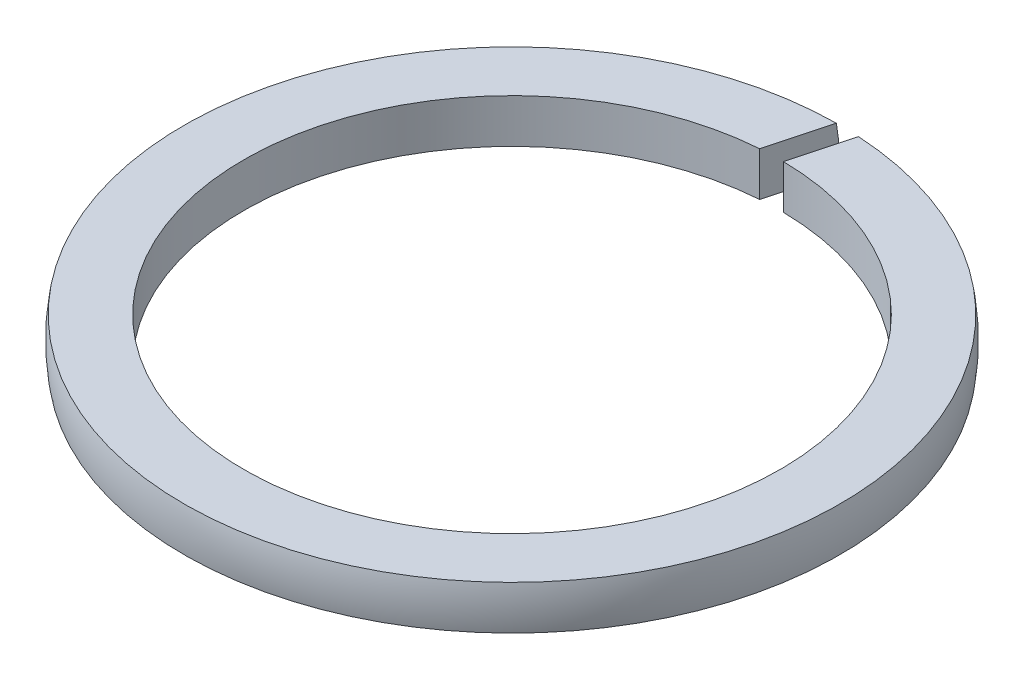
ISO-10303-21;
HEADER;
FILE_DESCRIPTION(('STEP AP214'),'2;1');
FILE_NAME('part.step','',(''),(''),'','','');
FILE_SCHEMA(('AUTOMOTIVE_DESIGN { 1 0 10303 214 1 1 1 1 }'));
ENDSEC;
DATA;
#1=APPLICATION_CONTEXT('core data for automotive mechanical design processes');
#2=APPLICATION_PROTOCOL_DEFINITION('international standard','automotive_design',2000,#1);
#3=PRODUCT_CONTEXT('',#1,'mechanical');
#4=PRODUCT('Part','Part','',(#3));
#5=PRODUCT_RELATED_PRODUCT_CATEGORY('part','',(#4));
#6=PRODUCT_DEFINITION_FORMATION('','',#4);
#7=PRODUCT_DEFINITION_CONTEXT('part definition',#1,'design');
#8=PRODUCT_DEFINITION('design','',#6,#7);
#9=PRODUCT_DEFINITION_SHAPE('','',#8);
#10=(LENGTH_UNIT() NAMED_UNIT(*) SI_UNIT(.MILLI.,.METRE.));
#11=(NAMED_UNIT(*) PLANE_ANGLE_UNIT() SI_UNIT($,.RADIAN.));
#12=(NAMED_UNIT(*) SI_UNIT($,.STERADIAN.) SOLID_ANGLE_UNIT());
#13=UNCERTAINTY_MEASURE_WITH_UNIT(LENGTH_MEASURE(1.E-05),#10,'distance_accuracy_value','');
#14=(GEOMETRIC_REPRESENTATION_CONTEXT(3) GLOBAL_UNCERTAINTY_ASSIGNED_CONTEXT((#13)) GLOBAL_UNIT_ASSIGNED_CONTEXT((#10,
#11,#12)) REPRESENTATION_CONTEXT('',''));
#15=CARTESIAN_POINT('',(0.,0.,0.));
#16=DIRECTION('',(0.,0.,1.));
#17=DIRECTION('',(1.,0.,0.));
#18=AXIS2_PLACEMENT_3D('',#15,#16,#17);
#19=CARTESIAN_POINT('',(0.,0.,0.));
#20=DIRECTION('',(0.,-1.,0.));
#21=DIRECTION('',(0.,0.,-1.));
#22=AXIS2_PLACEMENT_3D('',#19,#20,#21);
#23=CYLINDRICAL_SURFACE('',#22,6.1);
#24=CARTESIAN_POINT('',(0.,0.5,0.));
#25=DIRECTION('',(0.,-1.,0.));
#26=DIRECTION('',(0.,0.,-1.));
#27=AXIS2_PLACEMENT_3D('',#24,#25,#26);
#28=CIRCLE('',#27,6.1);
#29=CARTESIAN_POINT('',(0.0720001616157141,0.5,-6.09957506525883));
#30=VERTEX_POINT('',#29);
#31=CARTESIAN_POINT('',(-0.449977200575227,0.5,-6.08338068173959));
#32=VERTEX_POINT('',#31);
#33=EDGE_CURVE('E41',#30,#32,#28,.T.);
#34=ORIENTED_EDGE('',*,*,#33,.F.);
#35=DIRECTION('',(0.,1.,0.));
#36=VECTOR('',#35,1.);
#37=CARTESIAN_POINT('',(0.0720001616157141,-0.5,-6.09957506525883));
#38=LINE('',#37,#36);
#39=CARTESIAN_POINT('',(0.0720001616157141,-0.5,-6.09957506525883));
#40=VERTEX_POINT('',#39);
#41=EDGE_CURVE('E88',#40,#30,#38,.T.);
#42=ORIENTED_EDGE('',*,*,#41,.F.);
#43=CARTESIAN_POINT('',(0.,-0.5,0.));
#44=DIRECTION('',(0.,-1.,0.));
#45=DIRECTION('',(0.,0.,-1.));
#46=AXIS2_PLACEMENT_3D('',#43,#44,#45);
#47=CIRCLE('',#46,6.1);
#48=CARTESIAN_POINT('',(-0.449977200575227,-0.5,-6.08338068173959));
#49=VERTEX_POINT('',#48);
#50=EDGE_CURVE('E87',#40,#49,#47,.T.);
#51=ORIENTED_EDGE('',*,*,#50,.T.);
#52=DIRECTION('',(0.,1.,0.));
#53=VECTOR('',#52,1.);
#54=CARTESIAN_POINT('',(-0.449977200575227,-0.5,-6.08338068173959));
#55=LINE('',#54,#53);
#56=EDGE_CURVE('E57',#49,#32,#55,.T.);
#57=ORIENTED_EDGE('',*,*,#56,.T.);
#58=EDGE_LOOP('',(#34,#42,#51,#57));
#59=FACE_BOUND('',#58,.T.);
#60=ADVANCED_FACE('F33',(#59),#23,.F.);
#61=CARTESIAN_POINT('',(-6.1,0.5,0.));
#62=DIRECTION('',(0.,-1.,0.));
#63=DIRECTION('',(0.,0.,-1.));
#64=AXIS2_PLACEMENT_3D('',#61,#62,#63);
#65=PLANE('',#64);
#66=CARTESIAN_POINT('',(0.,0.5,0.));
#67=DIRECTION('',(0.,-1.,0.));
#68=DIRECTION('',(0.,0.,-1.));
#69=AXIS2_PLACEMENT_3D('',#66,#67,#68);
#70=CIRCLE('',#69,7.45803989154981);
#71=CARTESIAN_POINT('',(0.432634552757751,0.5,-7.44548093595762));
#72=VERTEX_POINT('',#71);
#73=CARTESIAN_POINT('',(-0.0817584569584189,0.5,-7.45759174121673));
#74=VERTEX_POINT('',#73);
#75=EDGE_CURVE('E93',#72,#74,#70,.T.);
#76=ORIENTED_EDGE('',*,*,#75,.F.);
#77=DIRECTION('',(0.258819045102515,0.,-0.96592582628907));
#78=VECTOR('',#77,1.);
#79=CARTESIAN_POINT('',(0.448460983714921,0.5,-7.50454598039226));
#80=LINE('',#79,#78);
#81=EDGE_CURVE('E80',#30,#72,#80,.T.);
#82=ORIENTED_EDGE('',*,*,#81,.F.);
#83=ORIENTED_EDGE('',*,*,#33,.T.);
#84=DIRECTION('',(-0.258819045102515,0.,0.96592582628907));
#85=VECTOR('',#84,1.);
#86=CARTESIAN_POINT('',(-0.0704839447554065,0.5,-7.49966879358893));
#87=LINE('',#86,#85);
#88=EDGE_CURVE('E73',#74,#32,#87,.T.);
#89=ORIENTED_EDGE('',*,*,#88,.F.);
#90=EDGE_LOOP('',(#76,#82,#83,#89));
#91=FACE_BOUND('',#90,.T.);
#92=ADVANCED_FACE('F92',(#91),#65,.F.);
#93=CARTESIAN_POINT('',(0.,0.,0.));
#94=DIRECTION('',(0.,-1.,0.));
#95=DIRECTION('',(0.,0.,-1.));
#96=AXIS2_PLACEMENT_3D('',#93,#94,#95);
#97=TOROIDAL_SURFACE('',#96,4.5,3.);
#98=CARTESIAN_POINT('',(0.,-0.5,0.));
#99=DIRECTION('',(0.,-1.,0.));
#100=DIRECTION('',(0.,0.,-1.));
#101=AXIS2_PLACEMENT_3D('',#98,#99,#100);
#102=CIRCLE('',#101,7.45803989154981);
#103=CARTESIAN_POINT('',(0.432634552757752,-0.5,-7.44548093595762));
#104=VERTEX_POINT('',#103);
#105=CARTESIAN_POINT('',(-0.081758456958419,-0.5,-7.45759174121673));
#106=VERTEX_POINT('',#105);
#107=EDGE_CURVE('E95',#104,#106,#102,.T.);
#108=ORIENTED_EDGE('',*,*,#107,.F.);
#109=CARTESIAN_POINT('',(0.432625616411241,-0.50019999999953,-7.44544758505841));
#110=CARTESIAN_POINT('',(0.436330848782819,-0.417347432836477,-7.45927570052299));
#111=CARTESIAN_POINT('',(0.439111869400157,-0.333879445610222,-7.46965461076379));
#112=CARTESIAN_POINT('',(0.442801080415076,-0.166938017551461,-7.48342293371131));
#113=CARTESIAN_POINT('',(0.443722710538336,-0.0834690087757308,-7.4868625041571));
#114=CARTESIAN_POINT('',(0.443722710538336,0.0834690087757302,-7.4868625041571));
#115=CARTESIAN_POINT('',(0.442801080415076,0.166938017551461,-7.48342293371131));
#116=CARTESIAN_POINT('',(0.439111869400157,0.333879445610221,-7.46965461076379));
#117=CARTESIAN_POINT('',(0.436330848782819,0.417347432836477,-7.45927570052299));
#118=CARTESIAN_POINT('',(0.432625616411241,0.50019999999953,-7.44544758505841));
#119=B_SPLINE_CURVE_WITH_KNOTS('',3,(#109,#110,#111,#112,#113,#114,#115,#116,#117,#118),
.UNSPECIFIED.,.F.,.F.,(4,2,2,2,4),(0.,0.252161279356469,0.50249330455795,0.75282532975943,
1.0049866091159),.UNSPECIFIED.);
#120=EDGE_CURVE('E49',#104,#72,#119,.T.);
#121=ORIENTED_EDGE('',*,*,#120,.T.);
#122=ORIENTED_EDGE('',*,*,#75,.T.);
#123=CARTESIAN_POINT('',(-0.0817675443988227,0.5002,-7.45755782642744));
#124=CARTESIAN_POINT('',(-0.0780002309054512,0.417364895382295,-7.47161763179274));
#125=CARTESIAN_POINT('',(-0.0751722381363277,0.33389347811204,-7.48217184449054));
#126=CARTESIAN_POINT('',(-0.0714211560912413,0.166944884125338,-7.49617107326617));
#127=CARTESIAN_POINT('',(-0.070483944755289,0.083472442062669,-7.49966879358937));
#128=CARTESIAN_POINT('',(-0.070483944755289,-0.0834724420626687,-7.49966879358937));
#129=CARTESIAN_POINT('',(-0.0714211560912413,-0.166944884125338,-7.49617107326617));
#130=CARTESIAN_POINT('',(-0.0751722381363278,-0.33389347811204,-7.48217184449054));
#131=CARTESIAN_POINT('',(-0.0780002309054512,-0.417364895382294,-7.47161763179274));
#132=CARTESIAN_POINT('',(-0.0817675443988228,-0.5002,-7.45755782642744));
#133=B_SPLINE_CURVE_WITH_KNOTS('',3,(#123,#124,#125,#126,#127,#128,#129,#130,#131,#132),
.UNSPECIFIED.,.F.,.F.,(4,2,2,2,4),(0.,0.252230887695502,0.502570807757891,0.752910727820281,
1.00514161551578),.UNSPECIFIED.);
#134=EDGE_CURVE('E75',#74,#106,#133,.T.);
#135=ORIENTED_EDGE('',*,*,#134,.T.);
#136=EDGE_LOOP('',(#108,#121,#122,#135));
#137=FACE_BOUND('',#136,.T.);
#138=ADVANCED_FACE('F119',(#137),#97,.T.);
#139=CARTESIAN_POINT('',(-6.1,-0.5,0.));
#140=DIRECTION('',(0.,1.,0.));
#141=DIRECTION('',(0.,0.,1.));
#142=AXIS2_PLACEMENT_3D('',#139,#140,#141);
#143=PLANE('',#142);
#144=ORIENTED_EDGE('',*,*,#50,.F.);
#145=DIRECTION('',(0.258819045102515,0.,-0.96592582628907));
#146=VECTOR('',#145,1.);
#147=CARTESIAN_POINT('',(0.448460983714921,-0.5,-7.50454598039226));
#148=LINE('',#147,#146);
#149=EDGE_CURVE('E89',#40,#104,#148,.T.);
#150=ORIENTED_EDGE('',*,*,#149,.T.);
#151=ORIENTED_EDGE('',*,*,#107,.T.);
#152=DIRECTION('',(-0.258819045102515,0.,0.96592582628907));
#153=VECTOR('',#152,1.);
#154=CARTESIAN_POINT('',(-2.3493021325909,-0.5,1.00499646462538));
#155=LINE('',#154,#153);
#156=EDGE_CURVE('E11',#106,#49,#155,.T.);
#157=ORIENTED_EDGE('',*,*,#156,.T.);
#158=EDGE_LOOP('',(#144,#150,#151,#157));
#159=FACE_BOUND('',#158,.T.);
#160=ADVANCED_FACE('F127',(#159),#143,.F.);
#161=CARTESIAN_POINT('',(-0.0704839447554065,-0.5,-7.49966879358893));
#162=DIRECTION('',(-0.96592582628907,0.,-0.258819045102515));
#163=DIRECTION('',(-0.258819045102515,0.,0.96592582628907));
#164=AXIS2_PLACEMENT_3D('',#161,#162,#163);
#165=PLANE('',#164);
#166=ORIENTED_EDGE('',*,*,#88,.T.);
#167=ORIENTED_EDGE('',*,*,#56,.F.);
#168=ORIENTED_EDGE('',*,*,#156,.F.);
#169=ORIENTED_EDGE('',*,*,#134,.F.);
#170=EDGE_LOOP('',(#166,#167,#168,#169));
#171=FACE_BOUND('',#170,.T.);
#172=ADVANCED_FACE('F74',(#171),#165,.F.);
#173=CARTESIAN_POINT('',(0.448460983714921,-0.5,-7.50454598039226));
#174=DIRECTION('',(0.96592582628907,0.,0.258819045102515));
#175=DIRECTION('',(0.258819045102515,0.,-0.96592582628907));
#176=AXIS2_PLACEMENT_3D('',#173,#174,#175);
#177=PLANE('',#176);
#178=ORIENTED_EDGE('',*,*,#149,.F.);
#179=ORIENTED_EDGE('',*,*,#41,.T.);
#180=ORIENTED_EDGE('',*,*,#81,.T.);
#181=ORIENTED_EDGE('',*,*,#120,.F.);
#182=EDGE_LOOP('',(#178,#179,#180,#181));
#183=FACE_BOUND('',#182,.T.);
#184=ADVANCED_FACE('F122',(#183),#177,.F.);
#185=CLOSED_SHELL('',(#60,#92,#138,#160,#172,#184));
#186=MANIFOLD_SOLID_BREP('B2',#185);
#187=ADVANCED_BREP_SHAPE_REPRESENTATION('',(#18,#186),#14);
#188=SHAPE_DEFINITION_REPRESENTATION(#9,#187);
ENDSEC;
END-ISO-10303-21;
